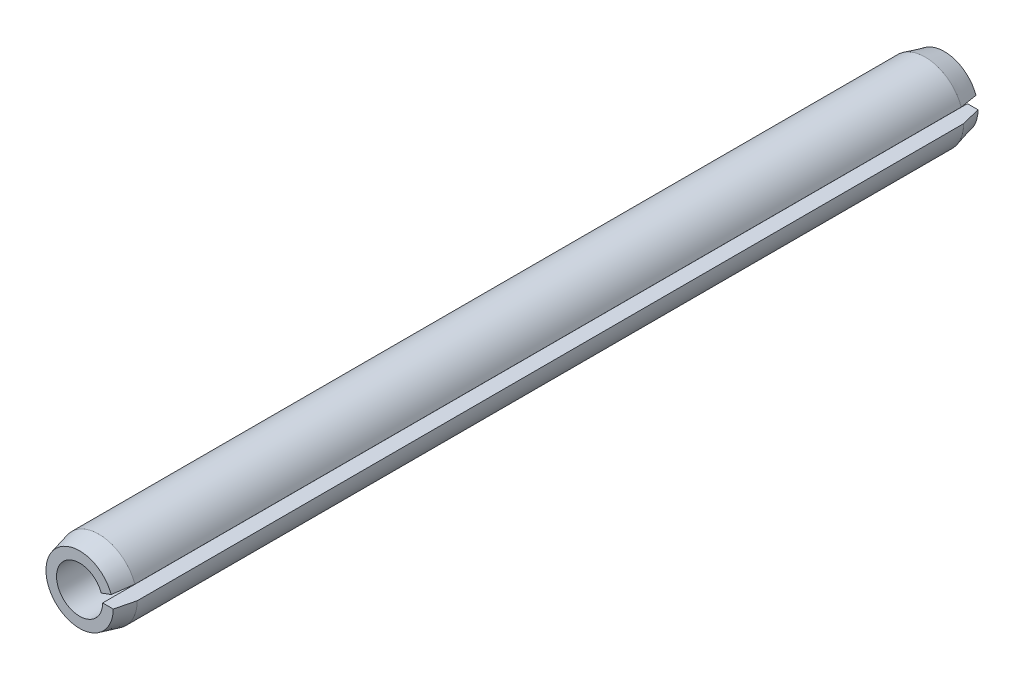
from build123d import *

# Parameters (mm, degrees)
BOSS_EXTRU_1_DEPTH = 45
CHANFREIN1_SIZE    = 0.25
CHANFREIN1_SIZE2   = 1
CHANFREIN2_SIZE    = 1
CHANFREIN2_SIZE2   = 0.25


with BuildPart() as part:
    # Esquisse1 → Boss.-Extru.1 (new body)
    with BuildSketch(Plane.XY):
        with BuildLine():
            Line((1.2, 0), (2, 0))
            ThreePointArc((2, 0), (-1.969615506, -0.347296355), (1.879385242, 0.684040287))
            Line((1.879385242, 0.684040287), (1.127631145, 0.410424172))
            ThreePointArc((1.127631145, 0.410424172), (-1.181769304, -0.208377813), (1.2, 0))
        make_face()
    extrude(amount=BOSS_EXTRU_1_DEPTH)

    # Chanfrein1
    chanfrein1_edges = [part.edges().sort_by_distance(p)[0] for p in [
        (-1.969615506, -0.347296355, 0),
    ]]
    chanfrein1_side = [part.faces().sort_by_distance(p)[0] for p in [
        (1.484160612, 0.600389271, 0),
    ]]
    chamfer(chanfrein1_edges, length=CHANFREIN1_SIZE, length2=CHANFREIN1_SIZE2, reference=chanfrein1_side[0])

    # Chanfrein2
    chanfrein2_edges = [part.edges().sort_by_distance(p)[0] for p in [
        (-1.969615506, -0.347296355, 45),
    ]]
    chanfrein2_side = [part.faces().sort_by_distance(p)[0] for p in [
        (-1.969615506, -0.347296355, 23),
    ]]
    chamfer(chanfrein2_edges, length=CHANFREIN2_SIZE, length2=CHANFREIN2_SIZE2, reference=chanfrein2_side[0])


solid = part.part
